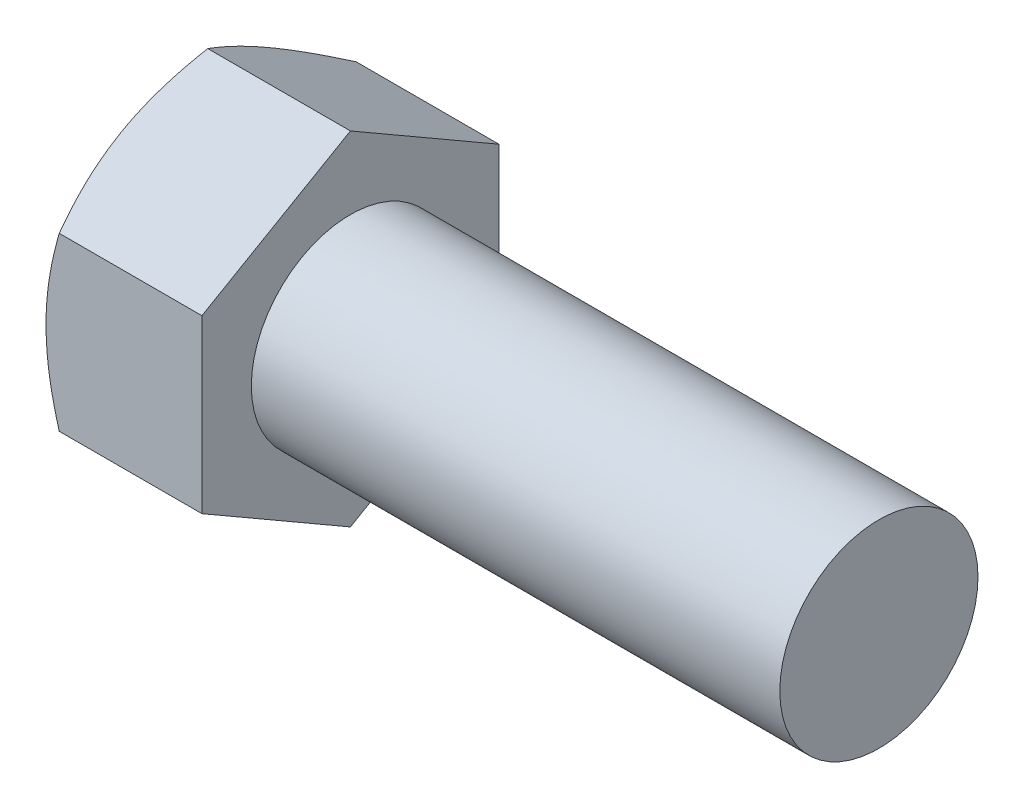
from build123d import *

# Parameters (mm, degrees)
HEX_DIE_START = -2e-06
SKETCH2_R     = 8.3242194
HEX_DIE_DEPTH = 7.493002
SKETCH4_R     = 6.245225
INDENT_DEPTH  = 0.936625


with BuildPart() as part:
    # BodySke → Base-Revolve (revolve)
    with BuildSketch(Plane.XY, mode=Mode.PRIVATE) as base_revolve_sk:
        Polygon((7.493, 4.7625), (7.493, 8.241801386), (0.637626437, 8.241801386), (0, 7.1374), (0, 0), (32.893, 0), (32.893, 4.7625), align=None)
    revolve(base_revolve_sk.sketch.rotate(Axis((-25.4, 0, 0), (1, 0, 0)), 90), axis=Axis((-25.4, 0, 0), (1, 0, 0)))

    # Sketch2 → Hex-Die (cut)
    with BuildSketch(Plane(origin=(0, 0, 0), x_dir=(0, 0, -1), z_dir=(1, 0, 0)).offset(HEX_DIE_START)):
        Circle(SKETCH2_R)
        Polygon((-7.1374, 4.120779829), (0, 8.241559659), (7.1374, 4.120779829), (7.1374, -4.120779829), (0, -8.241559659), (-7.1374, -4.120779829), align=None, mode=Mode.SUBTRACT)
    extrude(amount=HEX_DIE_DEPTH, mode=Mode.SUBTRACT)

    # Sketch4 → Indent (cut)
    with BuildSketch(Plane(origin=(0, 0, 0), x_dir=(0, 0, -1), z_dir=(1, 0, 0))):
        Circle(SKETCH4_R)
    extrude(amount=INDENT_DEPTH, mode=Mode.SUBTRACT)


solid = part.part
